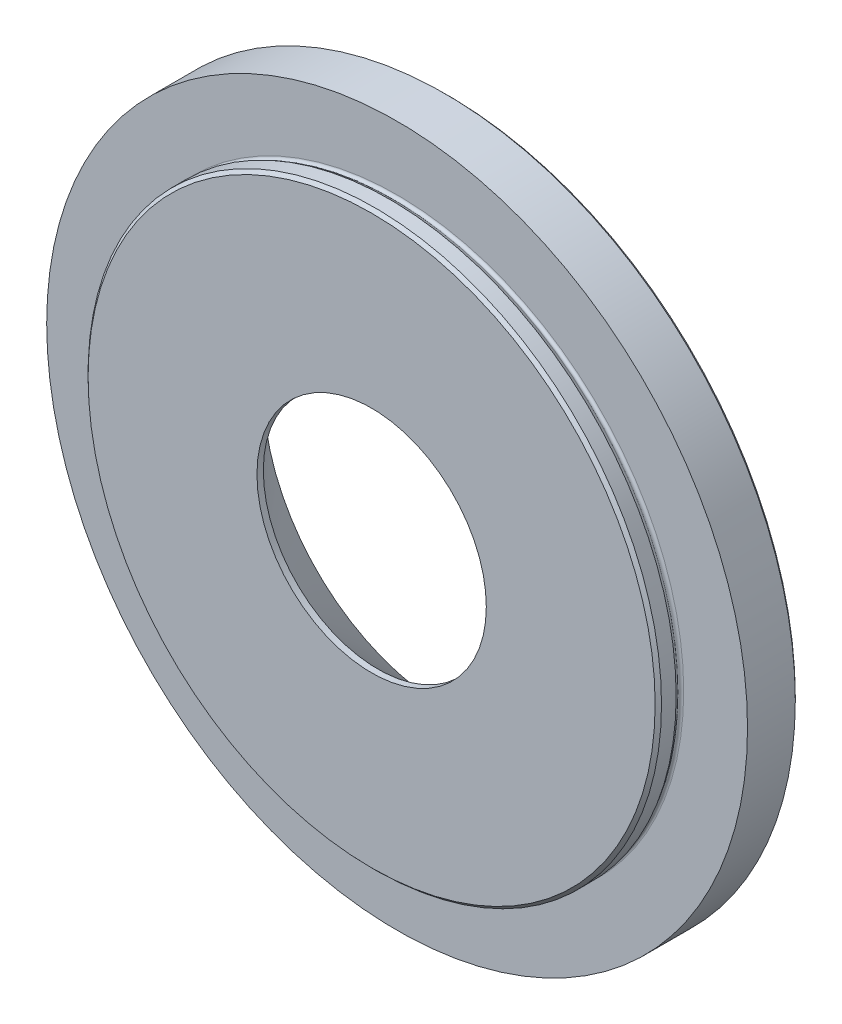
ISO-10303-21;
HEADER;
FILE_DESCRIPTION(('STEP AP214'),'2;1');
FILE_NAME('part.step','',(''),(''),'','','');
FILE_SCHEMA(('AUTOMOTIVE_DESIGN { 1 0 10303 214 1 1 1 1 }'));
ENDSEC;
DATA;
#1=APPLICATION_CONTEXT('core data for automotive mechanical design processes');
#2=APPLICATION_PROTOCOL_DEFINITION('international standard','automotive_design',2000,#1);
#3=PRODUCT_CONTEXT('',#1,'mechanical');
#4=PRODUCT('Part','Part','',(#3));
#5=PRODUCT_RELATED_PRODUCT_CATEGORY('part','',(#4));
#6=PRODUCT_DEFINITION_FORMATION('','',#4);
#7=PRODUCT_DEFINITION_CONTEXT('part definition',#1,'design');
#8=PRODUCT_DEFINITION('design','',#6,#7);
#9=PRODUCT_DEFINITION_SHAPE('','',#8);
#10=(LENGTH_UNIT() NAMED_UNIT(*) SI_UNIT(.MILLI.,.METRE.));
#11=(NAMED_UNIT(*) PLANE_ANGLE_UNIT() SI_UNIT($,.RADIAN.));
#12=(NAMED_UNIT(*) SI_UNIT($,.STERADIAN.) SOLID_ANGLE_UNIT());
#13=UNCERTAINTY_MEASURE_WITH_UNIT(LENGTH_MEASURE(1.E-05),#10,'distance_accuracy_value','');
#14=(GEOMETRIC_REPRESENTATION_CONTEXT(3) GLOBAL_UNCERTAINTY_ASSIGNED_CONTEXT((#13)) GLOBAL_UNIT_ASSIGNED_CONTEXT((#10,
#11,#12)) REPRESENTATION_CONTEXT('',''));
#15=CARTESIAN_POINT('',(0.,0.,0.));
#16=DIRECTION('',(0.,0.,1.));
#17=DIRECTION('',(1.,0.,0.));
#18=AXIS2_PLACEMENT_3D('',#15,#16,#17);
#19=CARTESIAN_POINT('',(0.,0.,4.));
#20=DIRECTION('',(0.,0.,1.));
#21=DIRECTION('',(1.,0.,0.));
#22=AXIS2_PLACEMENT_3D('',#19,#20,#21);
#23=CYLINDRICAL_SURFACE('',#22,45.);
#24=CARTESIAN_POINT('',(0.,0.,3.49999999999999));
#25=DIRECTION('',(0.,0.,1.));
#26=DIRECTION('',(1.,0.,0.));
#27=AXIS2_PLACEMENT_3D('',#24,#25,#26);
#28=CIRCLE('',#27,45.);
#29=CARTESIAN_POINT('',(45.,0.,3.49999999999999));
#30=VERTEX_POINT('',#29);
#31=EDGE_CURVE('E47',#30,#30,#28,.T.);
#32=ORIENTED_EDGE('',*,*,#31,.F.);
#33=EDGE_LOOP('',(#32));
#34=FACE_BOUND('',#33,.T.);
#35=CARTESIAN_POINT('',(0.,0.,1.2));
#36=DIRECTION('',(0.,0.,1.));
#37=DIRECTION('',(1.,0.,0.));
#38=AXIS2_PLACEMENT_3D('',#35,#36,#37);
#39=CIRCLE('',#38,45.);
#40=CARTESIAN_POINT('',(45.,0.,1.2));
#41=VERTEX_POINT('',#40);
#42=EDGE_CURVE('E70',#41,#41,#39,.T.);
#43=ORIENTED_EDGE('',*,*,#42,.T.);
#44=EDGE_LOOP('',(#43));
#45=FACE_BOUND('',#44,.T.);
#46=ADVANCED_FACE('F32',(#34,#45),#23,.T.);
#47=CARTESIAN_POINT('',(0.,44.5,4.));
#48=DIRECTION('',(0.,0.,-1.));
#49=DIRECTION('',(-1.,0.,0.));
#50=AXIS2_PLACEMENT_3D('',#47,#48,#49);
#51=PLANE('',#50);
#52=CARTESIAN_POINT('',(0.,0.,4.));
#53=DIRECTION('',(0.,0.,1.));
#54=DIRECTION('',(1.,0.,0.));
#55=AXIS2_PLACEMENT_3D('',#52,#53,#54);
#56=CIRCLE('',#55,18.);
#57=CARTESIAN_POINT('',(18.,0.,4.));
#58=VERTEX_POINT('',#57);
#59=EDGE_CURVE('E10',#58,#58,#56,.T.);
#60=ORIENTED_EDGE('',*,*,#59,.F.);
#61=EDGE_LOOP('',(#60));
#62=FACE_BOUND('',#61,.T.);
#63=CARTESIAN_POINT('',(0.,0.,4.));
#64=DIRECTION('',(0.,0.,1.));
#65=DIRECTION('',(1.,0.,0.));
#66=AXIS2_PLACEMENT_3D('',#63,#64,#65);
#67=CIRCLE('',#66,44.5);
#68=CARTESIAN_POINT('',(44.5,0.,4.));
#69=VERTEX_POINT('',#68);
#70=EDGE_CURVE('E52',#69,#69,#67,.T.);
#71=ORIENTED_EDGE('',*,*,#70,.T.);
#72=EDGE_LOOP('',(#71));
#73=FACE_BOUND('',#72,.T.);
#74=ADVANCED_FACE('F34',(#62,#73),#51,.F.);
#75=CARTESIAN_POINT('',(0.,0.,4.));
#76=DIRECTION('',(0.,0.,1.));
#77=DIRECTION('',(1.,0.,0.));
#78=AXIS2_PLACEMENT_3D('',#75,#76,#77);
#79=CYLINDRICAL_SURFACE('',#78,18.);
#80=CARTESIAN_POINT('',(0.,0.,3.));
#81=DIRECTION('',(0.,0.,1.));
#82=DIRECTION('',(1.,0.,0.));
#83=AXIS2_PLACEMENT_3D('',#80,#81,#82);
#84=CIRCLE('',#83,18.);
#85=CARTESIAN_POINT('',(18.,0.,3.));
#86=VERTEX_POINT('',#85);
#87=EDGE_CURVE('E39',#86,#86,#84,.T.);
#88=ORIENTED_EDGE('',*,*,#87,.F.);
#89=EDGE_LOOP('',(#88));
#90=FACE_BOUND('',#89,.T.);
#91=ORIENTED_EDGE('',*,*,#59,.T.);
#92=EDGE_LOOP('',(#91));
#93=FACE_BOUND('',#92,.T.);
#94=ADVANCED_FACE('F92',(#90,#93),#79,.F.);
#95=CARTESIAN_POINT('',(0.,0.,3.));
#96=DIRECTION('',(0.,0.,-1.));
#97=DIRECTION('',(-1.,0.,0.));
#98=AXIS2_PLACEMENT_3D('',#95,#96,#97);
#99=CONICAL_SURFACE('',#98,18.,0.785398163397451);
#100=CARTESIAN_POINT('',(0.,0.,-8.));
#101=DIRECTION('',(0.,0.,1.));
#102=DIRECTION('',(1.,0.,0.));
#103=AXIS2_PLACEMENT_3D('',#100,#101,#102);
#104=CIRCLE('',#103,29.0000000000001);
#105=CARTESIAN_POINT('',(29.,0.,-8.));
#106=VERTEX_POINT('',#105);
#107=EDGE_CURVE('E43',#106,#106,#104,.T.);
#108=ORIENTED_EDGE('',*,*,#107,.F.);
#109=EDGE_LOOP('',(#108));
#110=FACE_BOUND('',#109,.T.);
#111=ORIENTED_EDGE('',*,*,#87,.T.);
#112=EDGE_LOOP('',(#111));
#113=FACE_BOUND('',#112,.T.);
#114=ADVANCED_FACE('F102',(#110,#113),#99,.F.);
#115=CARTESIAN_POINT('',(0.,29.0000000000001,-8.));
#116=DIRECTION('',(0.,0.,1.));
#117=DIRECTION('',(1.,0.,0.));
#118=AXIS2_PLACEMENT_3D('',#115,#116,#117);
#119=PLANE('',#118);
#120=ORIENTED_EDGE('',*,*,#107,.T.);
#121=EDGE_LOOP('',(#120));
#122=FACE_BOUND('',#121,.T.);
#123=CARTESIAN_POINT('',(0.,0.,-8.));
#124=DIRECTION('',(0.,0.,1.));
#125=DIRECTION('',(1.,0.,0.));
#126=AXIS2_PLACEMENT_3D('',#123,#124,#125);
#127=CIRCLE('',#126,54.5);
#128=CARTESIAN_POINT('',(54.5,0.,-8.));
#129=VERTEX_POINT('',#128);
#130=EDGE_CURVE('E61',#129,#129,#127,.T.);
#131=ORIENTED_EDGE('',*,*,#130,.F.);
#132=EDGE_LOOP('',(#131));
#133=FACE_BOUND('',#132,.T.);
#134=ADVANCED_FACE('F99',(#122,#133),#119,.F.);
#135=CARTESIAN_POINT('',(0.,0.,3.49999999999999));
#136=DIRECTION('',(0.,0.,-1.));
#137=DIRECTION('',(-1.,0.,0.));
#138=AXIS2_PLACEMENT_3D('',#135,#136,#137);
#139=CONICAL_SURFACE('',#138,45.,0.785398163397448);
#140=ORIENTED_EDGE('',*,*,#70,.F.);
#141=EDGE_LOOP('',(#140));
#142=FACE_BOUND('',#141,.T.);
#143=ORIENTED_EDGE('',*,*,#31,.T.);
#144=EDGE_LOOP('',(#143));
#145=FACE_BOUND('',#144,.T.);
#146=ADVANCED_FACE('F97',(#142,#145),#139,.T.);
#147=CARTESIAN_POINT('',(0.,45.,0.));
#148=DIRECTION('',(0.,0.,-1.));
#149=DIRECTION('',(-1.,0.,0.));
#150=AXIS2_PLACEMENT_3D('',#147,#148,#149);
#151=PLANE('',#150);
#152=CARTESIAN_POINT('',(0.,0.,0.));
#153=DIRECTION('',(0.,0.,1.));
#154=DIRECTION('',(1.,0.,0.));
#155=AXIS2_PLACEMENT_3D('',#152,#153,#154);
#156=CIRCLE('',#155,55.);
#157=CARTESIAN_POINT('',(55.,0.,0.));
#158=VERTEX_POINT('',#157);
#159=EDGE_CURVE('E55',#158,#158,#156,.T.);
#160=ORIENTED_EDGE('',*,*,#159,.T.);
#161=EDGE_LOOP('',(#160));
#162=FACE_BOUND('',#161,.T.);
#163=CARTESIAN_POINT('',(0.,0.,0.));
#164=DIRECTION('',(0.,0.,1.));
#165=DIRECTION('',(1.,0.,0.));
#166=AXIS2_PLACEMENT_3D('',#163,#164,#165);
#167=CIRCLE('',#166,44.9859648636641);
#168=CARTESIAN_POINT('',(44.9859648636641,0.,0.));
#169=VERTEX_POINT('',#168);
#170=EDGE_CURVE('E64',#169,#169,#167,.T.);
#171=ORIENTED_EDGE('',*,*,#170,.F.);
#172=EDGE_LOOP('',(#171));
#173=FACE_BOUND('',#172,.T.);
#174=ADVANCED_FACE('F127',(#162,#173),#151,.F.);
#175=CARTESIAN_POINT('',(0.,0.,4.));
#176=DIRECTION('',(0.,0.,1.));
#177=DIRECTION('',(1.,0.,0.));
#178=AXIS2_PLACEMENT_3D('',#175,#176,#177);
#179=CYLINDRICAL_SURFACE('',#178,55.);
#180=ORIENTED_EDGE('',*,*,#159,.F.);
#181=EDGE_LOOP('',(#180));
#182=FACE_BOUND('',#181,.T.);
#183=CARTESIAN_POINT('',(0.,0.,-7.49999999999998));
#184=DIRECTION('',(0.,0.,1.));
#185=DIRECTION('',(1.,0.,0.));
#186=AXIS2_PLACEMENT_3D('',#183,#184,#185);
#187=CIRCLE('',#186,55.);
#188=CARTESIAN_POINT('',(55.,0.,-7.49999999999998));
#189=VERTEX_POINT('',#188);
#190=EDGE_CURVE('E58',#189,#189,#187,.T.);
#191=ORIENTED_EDGE('',*,*,#190,.T.);
#192=EDGE_LOOP('',(#191));
#193=FACE_BOUND('',#192,.T.);
#194=ADVANCED_FACE('F134',(#182,#193),#179,.T.);
#195=CARTESIAN_POINT('',(0.,0.,-8.));
#196=DIRECTION('',(0.,0.,1.));
#197=DIRECTION('',(1.,0.,0.));
#198=AXIS2_PLACEMENT_3D('',#195,#196,#197);
#199=CONICAL_SURFACE('',#198,54.5,0.785398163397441);
#200=ORIENTED_EDGE('',*,*,#190,.F.);
#201=EDGE_LOOP('',(#200));
#202=FACE_BOUND('',#201,.T.);
#203=ORIENTED_EDGE('',*,*,#130,.T.);
#204=EDGE_LOOP('',(#203));
#205=FACE_BOUND('',#204,.T.);
#206=ADVANCED_FACE('F83',(#202,#205),#199,.T.);
#207=CARTESIAN_POINT('',(0.,0.,0.400000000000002));
#208=DIRECTION('',(0.,0.,1.));
#209=DIRECTION('',(1.,0.,0.));
#210=AXIS2_PLACEMENT_3D('',#207,#208,#209);
#211=TOROIDAL_SURFACE('',#210,44.9859648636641,0.400000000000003);
#212=ORIENTED_EDGE('',*,*,#170,.T.);
#213=EDGE_LOOP('',(#212));
#214=FACE_BOUND('',#213,.T.);
#215=CARTESIAN_POINT('',(0.,0.,0.606015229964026));
#216=DIRECTION('',(0.,0.,1.));
#217=DIRECTION('',(1.,0.,0.));
#218=AXIS2_PLACEMENT_3D('',#215,#216,#217);
#219=CIRCLE('',#218,44.6430979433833);
#220=CARTESIAN_POINT('',(44.6430979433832,0.,0.606015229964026));
#221=VERTEX_POINT('',#220);
#222=EDGE_CURVE('E67',#221,#221,#219,.T.);
#223=ORIENTED_EDGE('',*,*,#222,.F.);
#224=EDGE_LOOP('',(#223));
#225=FACE_BOUND('',#224,.T.);
#226=ADVANCED_FACE('F77',(#214,#225),#211,.F.);
#227=CARTESIAN_POINT('',(0.,0.,1.2));
#228=DIRECTION('',(0.,0.,1.));
#229=DIRECTION('',(1.,0.,0.));
#230=AXIS2_PLACEMENT_3D('',#227,#228,#229);
#231=CONICAL_SURFACE('',#230,45.,0.541052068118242);
#232=ORIENTED_EDGE('',*,*,#222,.T.);
#233=EDGE_LOOP('',(#232));
#234=FACE_BOUND('',#233,.T.);
#235=ORIENTED_EDGE('',*,*,#42,.F.);
#236=EDGE_LOOP('',(#235));
#237=FACE_BOUND('',#236,.T.);
#238=ADVANCED_FACE('F75',(#234,#237),#231,.T.);
#239=CLOSED_SHELL('',(#46,#74,#94,#114,#134,#146,#174,#194,#206,#226,#238));
#240=MANIFOLD_SOLID_BREP('B2',#239);
#241=ADVANCED_BREP_SHAPE_REPRESENTATION('',(#18,#240),#14);
#242=SHAPE_DEFINITION_REPRESENTATION(#9,#241);
ENDSEC;
END-ISO-10303-21;
